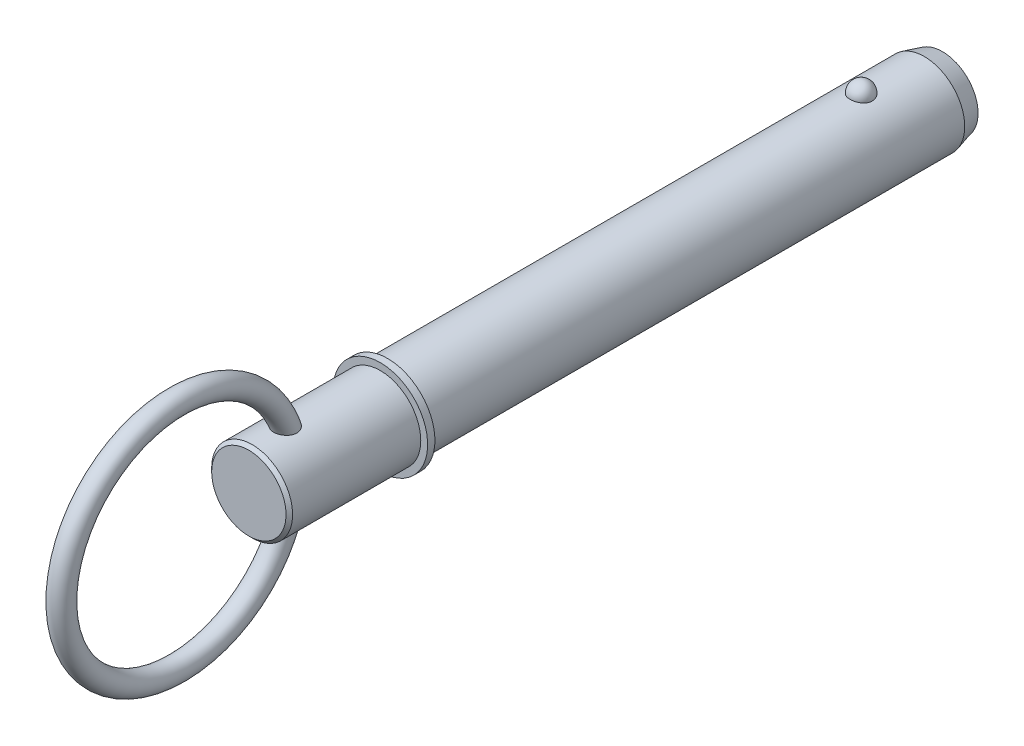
ISO-10303-21;
HEADER;
FILE_DESCRIPTION(('STEP AP214'),'2;1');
FILE_NAME('part.step','',(''),(''),'','','');
FILE_SCHEMA(('AUTOMOTIVE_DESIGN { 1 0 10303 214 1 1 1 1 }'));
ENDSEC;
DATA;
#1=APPLICATION_CONTEXT('core data for automotive mechanical design processes');
#2=APPLICATION_PROTOCOL_DEFINITION('international standard','automotive_design',2000,#1);
#3=PRODUCT_CONTEXT('',#1,'mechanical');
#4=PRODUCT('Part','Part','',(#3));
#5=PRODUCT_RELATED_PRODUCT_CATEGORY('part','',(#4));
#6=PRODUCT_DEFINITION_FORMATION('','',#4);
#7=PRODUCT_DEFINITION_CONTEXT('part definition',#1,'design');
#8=PRODUCT_DEFINITION('design','',#6,#7);
#9=PRODUCT_DEFINITION_SHAPE('','',#8);
#10=(LENGTH_UNIT() NAMED_UNIT(*) SI_UNIT(.MILLI.,.METRE.));
#11=(NAMED_UNIT(*) PLANE_ANGLE_UNIT() SI_UNIT($,.RADIAN.));
#12=(NAMED_UNIT(*) SI_UNIT($,.STERADIAN.) SOLID_ANGLE_UNIT());
#13=UNCERTAINTY_MEASURE_WITH_UNIT(LENGTH_MEASURE(1.E-05),#10,'distance_accuracy_value','');
#14=(GEOMETRIC_REPRESENTATION_CONTEXT(3) GLOBAL_UNCERTAINTY_ASSIGNED_CONTEXT((#13)) GLOBAL_UNIT_ASSIGNED_CONTEXT((#10,
#11,#12)) REPRESENTATION_CONTEXT('',''));
#15=CARTESIAN_POINT('',(0.,0.,0.));
#16=DIRECTION('',(0.,0.,1.));
#17=DIRECTION('',(1.,0.,0.));
#18=AXIS2_PLACEMENT_3D('',#15,#16,#17);
#19=CARTESIAN_POINT('',(0.,0.,127.));
#20=DIRECTION('',(0.,0.,-1.));
#21=DIRECTION('',(-1.,0.,0.));
#22=AXIS2_PLACEMENT_3D('',#19,#20,#21);
#23=CYLINDRICAL_SURFACE('',#22,11.115);
#24=CARTESIAN_POINT('',(3.04058343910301,10.6910278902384,-3.07));
#25=CARTESIAN_POINT('',(3.04058039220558,10.6910304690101,-2.89837124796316));
#26=CARTESIAN_POINT('',(3.02657193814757,10.6950430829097,-2.72670368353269));
#27=CARTESIAN_POINT('',(2.97087341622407,10.7106465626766,-2.38822964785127));
#28=CARTESIAN_POINT('',(2.92917240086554,10.7222404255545,-2.22142512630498));
#29=CARTESIAN_POINT('',(2.81915317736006,10.751689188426,-1.89750816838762));
#30=CARTESIAN_POINT('',(2.75084669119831,10.7695413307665,-1.7403914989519));
#31=CARTESIAN_POINT('',(2.58932284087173,10.809510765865,-1.44013959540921));
#32=CARTESIAN_POINT('',(2.49610617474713,10.8316279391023,-1.29700396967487));
#33=CARTESIAN_POINT('',(2.28659317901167,10.877786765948,-1.02797591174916));
#34=CARTESIAN_POINT('',(2.17018825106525,10.9018371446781,-0.902169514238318));
#35=CARTESIAN_POINT('',(1.91759004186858,10.9490888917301,-0.672091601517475));
#36=CARTESIAN_POINT('',(1.78139672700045,10.9722902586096,-0.567820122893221));
#37=CARTESIAN_POINT('',(1.49327884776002,11.0151925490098,-0.383992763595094));
#38=CARTESIAN_POINT('',(1.34139928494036,11.034903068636,-0.30436866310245));
#39=CARTESIAN_POINT('',(1.02584823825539,11.0686948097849,-0.171731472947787));
#40=CARTESIAN_POINT('',(0.86217801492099,11.0827766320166,-0.118715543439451));
#41=CARTESIAN_POINT('',(0.530748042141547,11.1035404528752,-0.0415304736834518));
#42=CARTESIAN_POINT('',(0.363109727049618,11.1103474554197,-0.0168734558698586));
#43=CARTESIAN_POINT('',(0.0259327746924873,11.1162480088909,0.00453486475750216));
#44=CARTESIAN_POINT('',(-0.143605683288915,11.1153422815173,0.00128877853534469));
#45=CARTESIAN_POINT('',(-0.477280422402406,11.1059854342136,-0.0327676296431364));
#46=CARTESIAN_POINT('',(-0.641459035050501,11.0976393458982,-0.0631942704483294));
#47=CARTESIAN_POINT('',(-0.962236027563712,11.0744390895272,-0.150220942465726));
#48=CARTESIAN_POINT('',(-1.11883427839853,11.0595848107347,-0.20682141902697));
#49=CARTESIAN_POINT('',(-1.4210461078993,11.0248420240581,-0.345028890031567));
#50=CARTESIAN_POINT('',(-1.56659244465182,11.0049254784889,-0.426775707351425));
#51=CARTESIAN_POINT('',(-1.84189316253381,10.9622119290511,-0.612956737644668));
#52=CARTESIAN_POINT('',(-1.97164597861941,10.9394146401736,-0.71739319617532));
#53=CARTESIAN_POINT('',(-2.21432263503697,10.8929139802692,-0.948332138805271));
#54=CARTESIAN_POINT('',(-2.3268890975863,10.8692016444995,-1.07520847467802));
#55=CARTESIAN_POINT('',(-2.52940007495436,10.8238699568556,-1.34622145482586));
#56=CARTESIAN_POINT('',(-2.6193430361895,10.8022507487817,-1.49035928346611));
#57=CARTESIAN_POINT('',(-2.77523958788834,10.7632629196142,-1.79367507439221));
#58=CARTESIAN_POINT('',(-2.8409151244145,10.7459442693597,-1.95300253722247));
#59=CARTESIAN_POINT('',(-2.94519180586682,10.7178360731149,-2.28083009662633));
#60=CARTESIAN_POINT('',(-2.98379371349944,10.707046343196,-2.44932993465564));
#61=CARTESIAN_POINT('',(-3.03284665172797,10.6932559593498,-2.78998091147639));
#62=CARTESIAN_POINT('',(-3.04341313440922,10.6902233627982,-2.96211412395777));
#63=CARTESIAN_POINT('',(-3.03646037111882,10.6922002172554,-3.305762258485));
#64=CARTESIAN_POINT('',(-3.0189418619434,10.6972094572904,-3.47727719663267));
#65=CARTESIAN_POINT('',(-2.95641582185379,10.7146564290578,-3.81396465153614));
#66=CARTESIAN_POINT('',(-2.91154117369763,10.7270582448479,-3.97916375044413));
#67=CARTESIAN_POINT('',(-2.79553341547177,10.7578713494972,-4.29947360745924));
#68=CARTESIAN_POINT('',(-2.72439927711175,10.7762828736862,-4.45458397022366));
#69=CARTESIAN_POINT('',(-2.55718900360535,10.8171819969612,-4.75123550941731));
#70=CARTESIAN_POINT('',(-2.46098224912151,10.8396907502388,-4.89270014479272));
#71=CARTESIAN_POINT('',(-2.24623042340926,10.8862165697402,-5.15724095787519));
#72=CARTESIAN_POINT('',(-2.12768452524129,10.9102336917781,-5.28031645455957));
#73=CARTESIAN_POINT('',(-1.87085107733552,10.9571990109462,-5.5050961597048));
#74=CARTESIAN_POINT('',(-1.73249451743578,10.9801430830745,-5.60672245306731));
#75=CARTESIAN_POINT('',(-1.44010079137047,11.0223008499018,-5.78517789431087));
#76=CARTESIAN_POINT('',(-1.28606470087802,11.0415148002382,-5.86200874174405));
#77=CARTESIAN_POINT('',(-0.968615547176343,11.0738491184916,-5.98788441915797));
#78=CARTESIAN_POINT('',(-0.805339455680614,11.0870408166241,-6.03725610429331));
#79=CARTESIAN_POINT('',(-0.47244987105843,11.1062048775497,-6.10820004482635));
#80=CARTESIAN_POINT('',(-0.302837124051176,11.11217808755,-6.1297755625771));
#81=CARTESIAN_POINT('',(0.0345765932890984,11.1162034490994,-6.14436196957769));
#82=CARTESIAN_POINT('',(0.20235372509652,11.1143988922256,-6.13788957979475));
#83=CARTESIAN_POINT('',(0.534364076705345,11.103390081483,-6.09773981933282));
#84=CARTESIAN_POINT('',(0.698597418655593,11.094186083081,-6.06406338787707));
#85=CARTESIAN_POINT('',(1.01830314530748,11.0694136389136,-5.97063285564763));
#86=CARTESIAN_POINT('',(1.17380497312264,11.0538682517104,-5.91097318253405));
#87=CARTESIAN_POINT('',(1.472484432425,11.0180608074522,-5.76723645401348));
#88=CARTESIAN_POINT('',(1.6156613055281,10.9977984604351,-5.68315789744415));
#89=CARTESIAN_POINT('',(1.88801614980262,10.9543574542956,-5.49138807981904));
#90=CARTESIAN_POINT('',(2.01695079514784,10.9311394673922,-5.38336024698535));
#91=CARTESIAN_POINT('',(2.25501495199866,10.8845248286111,-5.14733839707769));
#92=CARTESIAN_POINT('',(2.36414099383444,10.8611281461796,-5.01934088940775));
#93=CARTESIAN_POINT('',(2.56152595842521,10.8162958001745,-4.74447932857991));
#94=CARTESIAN_POINT('',(2.64940088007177,10.7948999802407,-4.59733288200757));
#95=CARTESIAN_POINT('',(2.79961494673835,10.7569242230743,-4.29001203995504));
#96=CARTESIAN_POINT('',(2.86196390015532,10.7403424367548,-4.12984267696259));
#97=CARTESIAN_POINT('',(2.95377333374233,10.715429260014,-3.820623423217));
#98=CARTESIAN_POINT('',(2.98627018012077,10.7063495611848,-3.6725268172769));
#99=CARTESIAN_POINT('',(3.02967634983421,10.6941478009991,-3.37296350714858));
#100=CARTESIAN_POINT('',(3.04058612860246,10.6910256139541,-3.22149687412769));
#101=CARTESIAN_POINT('',(3.04058343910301,10.6910278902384,-3.07));
#102=B_SPLINE_CURVE_WITH_KNOTS('',3,(#24,#25,#26,#27,#28,#29,#30,#31,#32,#33,#34,#35,#36,#37,
#38,#39,#40,#41,#42,#43,#44,#45,#46,#47,#48,#49,#50,#51,#52,#53,#54,#55,#56,#57,#58,#59,#60,#61,
#62,#63,#64,#65,#66,#67,#68,#69,#70,#71,#72,#73,#74,#75,#76,#77,#78,#79,#80,#81,#82,#83,#84,#85,
#86,#87,#88,#89,#90,#91,#92,#93,#94,#95,#96,#97,#98,#99,#100,#101),.UNSPECIFIED.,.T.,.F.,(4,2,2,
2,2,2,2,2,2,2,2,2,2,2,2,2,2,2,2,2,2,2,2,2,2,2,2,2,2,2,2,2,2,2,2,2,2,2,4),(0.,0.514341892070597,
1.02888723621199,1.54320613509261,2.0575106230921,2.57428293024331,3.09105611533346,
3.60638589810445,4.1216606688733,4.62793159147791,5.1341551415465,5.63334381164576,
6.13254097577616,6.63456562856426,7.13663998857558,7.64804063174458,8.15947638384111,
8.6766026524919,9.19371435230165,9.70869321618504,10.223658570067,10.7361421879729,
11.2486458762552,11.7638748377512,12.2791228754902,12.7962115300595,13.3132647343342,
13.8240238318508,14.3347229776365,14.8360540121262,15.3373677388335,15.8368746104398,
16.3364121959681,16.8434736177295,17.3506237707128,17.8663484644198,18.3818748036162,
18.8358944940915,19.2899046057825),.UNSPECIFIED.);
#103=CARTESIAN_POINT('',(3.04058343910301,10.6910278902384,-3.07));
#104=VERTEX_POINT('',#103);
#105=EDGE_CURVE('E103',#104,#104,#102,.T.);
#106=ORIENTED_EDGE('',*,*,#105,.T.);
#107=EDGE_LOOP('',(#106));
#108=FACE_BOUND('',#107,.T.);
#109=CARTESIAN_POINT('',(0.,0.,-20.4));
#110=DIRECTION('',(0.,0.,-1.));
#111=DIRECTION('',(-1.,0.,0.));
#112=AXIS2_PLACEMENT_3D('',#109,#110,#111);
#113=CIRCLE('',#112,11.115);
#114=CARTESIAN_POINT('',(-11.115,0.,-20.4));
#115=VERTEX_POINT('',#114);
#116=EDGE_CURVE('E110',#115,#115,#113,.F.);
#117=ORIENTED_EDGE('',*,*,#116,.T.);
#118=EDGE_LOOP('',(#117));
#119=FACE_BOUND('',#118,.T.);
#120=CARTESIAN_POINT('',(0.,0.,127.));
#121=DIRECTION('',(0.,0.,1.));
#122=DIRECTION('',(1.,0.,0.));
#123=AXIS2_PLACEMENT_3D('',#120,#121,#122);
#124=CIRCLE('',#123,11.115);
#125=CARTESIAN_POINT('',(11.115,0.,127.));
#126=VERTEX_POINT('',#125);
#127=EDGE_CURVE('E108',#126,#126,#124,.T.);
#128=ORIENTED_EDGE('',*,*,#127,.F.);
#129=EDGE_LOOP('',(#128));
#130=FACE_BOUND('',#129,.T.);
#131=ADVANCED_FACE('F39',(#108,#119,#130),#23,.T.);
#132=CARTESIAN_POINT('',(0.,0.,-25.4));
#133=DIRECTION('',(0.,0.,-1.));
#134=DIRECTION('',(-1.,0.,0.));
#135=AXIS2_PLACEMENT_3D('',#132,#133,#134);
#136=PLANE('',#135);
#137=CARTESIAN_POINT('',(0.,0.,-25.4));
#138=DIRECTION('',(0.,0.,-1.));
#139=DIRECTION('',(-1.,0.,0.));
#140=AXIS2_PLACEMENT_3D('',#137,#138,#139);
#141=CIRCLE('',#140,9.77525403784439);
#142=CARTESIAN_POINT('',(-9.77525403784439,0.,-25.4));
#143=VERTEX_POINT('',#142);
#144=EDGE_CURVE('E140',#143,#143,#141,.T.);
#145=ORIENTED_EDGE('',*,*,#144,.T.);
#146=EDGE_LOOP('',(#145));
#147=FACE_BOUND('',#146,.T.);
#148=ADVANCED_FACE('F89',(#147),#136,.T.);
#149=CARTESIAN_POINT('',(0.,0.,-25.4));
#150=DIRECTION('',(0.,0.,1.));
#151=DIRECTION('',(1.,0.,0.));
#152=AXIS2_PLACEMENT_3D('',#149,#150,#151);
#153=CONICAL_SURFACE('',#152,9.77525403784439,0.261799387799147);
#154=ORIENTED_EDGE('',*,*,#116,.F.);
#155=EDGE_LOOP('',(#154));
#156=FACE_BOUND('',#155,.T.);
#157=ORIENTED_EDGE('',*,*,#144,.F.);
#158=EDGE_LOOP('',(#157));
#159=FACE_BOUND('',#158,.T.);
#160=ADVANCED_FACE('F95',(#156,#159),#153,.T.);
#161=CARTESIAN_POINT('',(0.,11.115,-3.07));
#162=DIRECTION('',(0.,1.,0.));
#163=DIRECTION('',(0.,0.,-1.));
#164=AXIS2_PLACEMENT_3D('',#161,#162,#163);
#165=SPHERICAL_SURFACE('',#164,3.07);
#166=ORIENTED_EDGE('',*,*,#105,.F.);
#167=EDGE_LOOP('',(#166));
#168=FACE_BOUND('',#167,.T.);
#169=ADVANCED_FACE('F113',(#168),#165,.T.);
#170=CARTESIAN_POINT('',(0.,0.,127.));
#171=DIRECTION('',(0.,0.,-1.));
#172=DIRECTION('',(-1.,0.,0.));
#173=AXIS2_PLACEMENT_3D('',#170,#171,#172);
#174=PLANE('',#173);
#175=ORIENTED_EDGE('',*,*,#127,.T.);
#176=EDGE_LOOP('',(#175));
#177=FACE_BOUND('',#176,.T.);
#178=CARTESIAN_POINT('',(0.,0.,127.));
#179=DIRECTION('',(0.,0.,-1.));
#180=DIRECTION('',(-1.,0.,0.));
#181=AXIS2_PLACEMENT_3D('',#178,#179,#180);
#182=CIRCLE('',#181,13.);
#183=CARTESIAN_POINT('',(-13.,0.,127.));
#184=VERTEX_POINT('',#183);
#185=EDGE_CURVE('E109',#184,#184,#182,.T.);
#186=ORIENTED_EDGE('',*,*,#185,.T.);
#187=EDGE_LOOP('',(#186));
#188=FACE_BOUND('',#187,.T.);
#189=ADVANCED_FACE('F117',(#177,#188),#174,.T.);
#190=CARTESIAN_POINT('',(0.,0.,33.7287874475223));
#191=DIRECTION('',(0.,0.,-1.));
#192=DIRECTION('',(-1.,0.,0.));
#193=AXIS2_PLACEMENT_3D('',#190,#191,#192);
#194=CYLINDRICAL_SURFACE('',#193,13.);
#195=CARTESIAN_POINT('',(0.,0.,129.));
#196=DIRECTION('',(0.,0.,-1.));
#197=DIRECTION('',(-1.,0.,0.));
#198=AXIS2_PLACEMENT_3D('',#195,#196,#197);
#199=CIRCLE('',#198,13.);
#200=CARTESIAN_POINT('',(-13.,0.,129.));
#201=VERTEX_POINT('',#200);
#202=EDGE_CURVE('E134',#201,#201,#199,.T.);
#203=ORIENTED_EDGE('',*,*,#202,.T.);
#204=EDGE_LOOP('',(#203));
#205=FACE_BOUND('',#204,.T.);
#206=ORIENTED_EDGE('',*,*,#185,.F.);
#207=EDGE_LOOP('',(#206));
#208=FACE_BOUND('',#207,.T.);
#209=ADVANCED_FACE('F121',(#205,#208),#194,.T.);
#210=CARTESIAN_POINT('',(0.,13.,129.));
#211=DIRECTION('',(0.,0.,1.));
#212=DIRECTION('',(1.,0.,0.));
#213=AXIS2_PLACEMENT_3D('',#210,#211,#212);
#214=PLANE('',#213);
#215=CARTESIAN_POINT('',(0.,0.,129.));
#216=DIRECTION('',(0.,0.,1.));
#217=DIRECTION('',(1.,0.,0.));
#218=AXIS2_PLACEMENT_3D('',#215,#216,#217);
#219=CIRCLE('',#218,11.115);
#220=CARTESIAN_POINT('',(11.115,0.,129.));
#221=VERTEX_POINT('',#220);
#222=EDGE_CURVE('E112',#221,#221,#219,.T.);
#223=ORIENTED_EDGE('',*,*,#222,.F.);
#224=EDGE_LOOP('',(#223));
#225=FACE_BOUND('',#224,.T.);
#226=ORIENTED_EDGE('',*,*,#202,.F.);
#227=EDGE_LOOP('',(#226));
#228=FACE_BOUND('',#227,.T.);
#229=ADVANCED_FACE('F86',(#225,#228),#214,.T.);
#230=CARTESIAN_POINT('',(0.,0.,165.1));
#231=DIRECTION('',(0.,0.,-1.));
#232=DIRECTION('',(-1.,0.,0.));
#233=AXIS2_PLACEMENT_3D('',#230,#231,#232);
#234=CYLINDRICAL_SURFACE('',#233,11.115);
#235=CARTESIAN_POINT('',(-1.22435852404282,-11.0473603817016,152.178419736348));
#236=CARTESIAN_POINT('',(-1.0707801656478,-11.0643805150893,152.111699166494));
#237=CARTESIAN_POINT('',(-0.911372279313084,-11.0787777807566,152.057745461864));
#238=CARTESIAN_POINT('',(-0.585451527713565,-11.1007717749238,151.976552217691));
#239=CARTESIAN_POINT('',(-0.418938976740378,-11.1083688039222,151.949311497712));
#240=CARTESIAN_POINT('',(-0.0835394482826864,-11.1159515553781,151.922121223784));
#241=CARTESIAN_POINT('',(0.0853474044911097,-11.1159376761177,151.922170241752));
#242=CARTESIAN_POINT('',(0.420723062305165,-11.1083011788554,151.949554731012));
#243=CARTESIAN_POINT('',(0.58721183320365,-11.1006784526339,151.976890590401));
#244=CARTESIAN_POINT('',(0.913189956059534,-11.0786293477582,152.05829957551));
#245=CARTESIAN_POINT('',(1.07267378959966,-11.0641977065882,152.112393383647));
#246=CARTESIAN_POINT('',(1.3799404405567,-11.0300907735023,152.246140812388));
#247=CARTESIAN_POINT('',(1.52772335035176,-11.0104155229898,152.325794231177));
#248=CARTESIAN_POINT('',(1.80679367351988,-10.9680716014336,152.508467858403));
#249=CARTESIAN_POINT('',(1.93814041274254,-10.945414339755,152.611400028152));
#250=CARTESIAN_POINT('',(2.18117403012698,-10.8995884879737,152.838212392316));
#251=CARTESIAN_POINT('',(2.29286356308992,-10.8764199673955,152.962089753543));
#252=CARTESIAN_POINT('',(2.49238969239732,-10.8324319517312,153.225992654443));
#253=CARTESIAN_POINT('',(2.58046870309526,-10.8115899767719,153.365831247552));
#254=CARTESIAN_POINT('',(2.73218762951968,-10.7742522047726,153.658691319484));
#255=CARTESIAN_POINT('',(2.7958294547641,-10.757756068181,153.811711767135));
#256=CARTESIAN_POINT('',(2.89767977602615,-10.7307723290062,154.1266092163));
#257=CARTESIAN_POINT('',(2.93586554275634,-10.7202900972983,154.288493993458));
#258=CARTESIAN_POINT('',(2.98678800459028,-10.7062139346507,154.616480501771));
#259=CARTESIAN_POINT('',(2.99951894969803,-10.7026215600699,154.782583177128));
#260=CARTESIAN_POINT('',(3.0004780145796,-10.7023530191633,155.123227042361));
#261=CARTESIAN_POINT('',(2.98743421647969,-10.7060358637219,155.297770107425));
#262=CARTESIAN_POINT('',(2.93592917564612,-10.7202719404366,155.642750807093));
#263=CARTESIAN_POINT('',(2.8974582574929,-10.7308277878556,155.813186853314));
#264=CARTESIAN_POINT('',(2.79180512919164,-10.7588257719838,156.163114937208));
#265=CARTESIAN_POINT('',(2.72213928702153,-10.776850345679,156.341811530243));
#266=CARTESIAN_POINT('',(2.55612841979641,-10.8174264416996,156.685974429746));
#267=CARTESIAN_POINT('',(2.4597569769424,-10.8399824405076,156.851427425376));
#268=CARTESIAN_POINT('',(2.23434632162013,-10.8887625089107,157.175672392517));
#269=CARTESIAN_POINT('',(2.10349593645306,-10.9151327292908,157.333192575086));
#270=CARTESIAN_POINT('',(1.81505097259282,-10.96677510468,157.621668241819));
#271=CARTESIAN_POINT('',(1.65749731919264,-10.9920488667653,157.75266371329));
#272=CARTESIAN_POINT('',(1.36197799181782,-11.0319737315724,157.951313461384));
#273=CARTESIAN_POINT('',(1.22927684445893,-11.0476896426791,158.02660092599));
#274=CARTESIAN_POINT('',(0.952979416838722,-11.0749380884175,158.154574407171));
#275=CARTESIAN_POINT('',(0.809393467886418,-11.0864745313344,158.207281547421));
#276=CARTESIAN_POINT('',(0.513954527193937,-11.1041011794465,158.287058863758));
#277=CARTESIAN_POINT('',(0.362058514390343,-11.1101594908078,158.313978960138));
#278=CARTESIAN_POINT('',(0.0557792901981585,-11.1159132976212,158.339559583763));
#279=CARTESIAN_POINT('',(-0.0986030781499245,-11.1156109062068,158.338229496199));
#280=CARTESIAN_POINT('',(-0.389768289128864,-11.1090283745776,158.308935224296));
#281=CARTESIAN_POINT('',(-0.526830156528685,-11.1033186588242,158.283512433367));
#282=CARTESIAN_POINT('',(-0.794878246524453,-11.0873547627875,158.211270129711));
#283=CARTESIAN_POINT('',(-0.925863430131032,-11.0770998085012,158.164446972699));
#284=CARTESIAN_POINT('',(-1.18354406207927,-11.0525934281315,158.049843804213));
#285=CARTESIAN_POINT('',(-1.30991621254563,-11.0382116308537,157.981371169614));
#286=CARTESIAN_POINT('',(-1.55122352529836,-11.0068962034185,157.827131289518));
#287=CARTESIAN_POINT('',(-1.66615377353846,-10.9899614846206,157.741356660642));
#288=CARTESIAN_POINT('',(-1.90024050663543,-10.9520991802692,157.54087205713));
#289=CARTESIAN_POINT('',(-2.01728342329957,-10.9309598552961,157.423737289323));
#290=CARTESIAN_POINT('',(-2.23333659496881,-10.8888735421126,157.173839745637));
#291=CARTESIAN_POINT('',(-2.33233396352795,-10.8679267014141,157.041065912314));
#292=CARTESIAN_POINT('',(-2.52607041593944,-10.8246766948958,156.740000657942));
#293=CARTESIAN_POINT('',(-2.61741570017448,-10.8027194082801,156.569462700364));
#294=CARTESIAN_POINT('',(-2.77251687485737,-10.7639568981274,156.215671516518));
#295=CARTESIAN_POINT('',(-2.83625783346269,-10.7471544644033,156.032411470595));
#296=CARTESIAN_POINT('',(-2.93668505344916,-10.7201706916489,155.646624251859));
#297=CARTESIAN_POINT('',(-2.97161961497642,-10.7104219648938,155.443594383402));
#298=CARTESIAN_POINT('',(-2.99683495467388,-10.7033740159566,155.136874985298));
#299=CARTESIAN_POINT('',(-3.00070536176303,-10.7022882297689,155.034234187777));
#300=CARTESIAN_POINT('',(-2.99908594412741,-10.7027439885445,154.829049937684));
#301=CARTESIAN_POINT('',(-2.99360154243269,-10.7042840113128,154.726506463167));
#302=CARTESIAN_POINT('',(-2.97382504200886,-10.7097936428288,154.530330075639));
#303=CARTESIAN_POINT('',(-2.9602439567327,-10.7135669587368,154.436619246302));
#304=CARTESIAN_POINT('',(-2.92480741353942,-10.723295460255,154.250932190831));
#305=CARTESIAN_POINT('',(-2.90295619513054,-10.7292495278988,154.15895510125));
#306=CARTESIAN_POINT('',(-2.85097003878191,-10.7431800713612,153.977547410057));
#307=CARTESIAN_POINT('',(-2.82083748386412,-10.7511559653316,153.888116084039));
#308=CARTESIAN_POINT('',(-2.75241691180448,-10.7688750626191,153.71264532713));
#309=CARTESIAN_POINT('',(-2.71412954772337,-10.7786181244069,153.62660562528));
#310=CARTESIAN_POINT('',(-2.59550576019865,-10.807996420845,153.391055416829));
#311=CARTESIAN_POINT('',(-2.50612224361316,-10.8292837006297,153.246173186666));
#312=CARTESIAN_POINT('',(-2.30366035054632,-10.8741467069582,152.974571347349));
#313=CARTESIAN_POINT('',(-2.19058370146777,-10.8977222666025,152.847850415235));
#314=CARTESIAN_POINT('',(-1.94442412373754,-10.9443154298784,152.616462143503));
#315=CARTESIAN_POINT('',(-1.81141354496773,-10.967334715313,152.51171820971));
#316=CARTESIAN_POINT('',(-1.52904284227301,-11.0102504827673,152.326435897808));
#317=CARTESIAN_POINT('',(-1.37968206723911,-11.0301468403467,152.245898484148));
#318=CARTESIAN_POINT('',(-1.22435852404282,-11.0473603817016,152.178419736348));
#319=B_SPLINE_CURVE_WITH_KNOTS('',3,(#235,#236,#237,#238,#239,#240,#241,#242,#243,#244,#245,
#246,#247,#248,#249,#250,#251,#252,#253,#254,#255,#256,#257,#258,#259,#260,#261,#262,#263,#264,
#265,#266,#267,#268,#269,#270,#271,#272,#273,#274,#275,#276,#277,#278,#279,#280,#281,#282,#283,
#284,#285,#286,#287,#288,#289,#290,#291,#292,#293,#294,#295,#296,#297,#298,#299,#300,#301,#302,
#303,#304,#305,#306,#307,#308,#309,#310,#311,#312,#313,#314,#315,#316,#317,#318),.UNSPECIFIED.,
.T.,.F.,(4,2,2,2,2,2,2,2,2,2,2,2,2,2,2,2,2,2,2,2,2,2,2,2,2,2,2,2,2,2,2,2,2,2,2,2,2,2,2,2,2,4),
(0.,0.504317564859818,1.00861284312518,1.51288173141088,2.01715779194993,2.52182424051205,
3.02648670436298,3.52927157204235,4.03198848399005,4.52932690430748,5.02662645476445,
5.5243694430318,6.02222485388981,6.545261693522,7.06849767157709,7.64398785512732,
8.22004937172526,8.83633461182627,9.45168373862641,9.90997173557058,10.3678300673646,
10.8283372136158,11.2886913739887,11.7053264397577,12.1220324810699,12.5537129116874,
12.9855779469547,13.4844842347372,13.9837454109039,14.5653303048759,15.1472294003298,
15.762338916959,16.0701226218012,16.3777279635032,16.6616380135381,16.9454027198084,
17.229085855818,17.5127462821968,18.0246262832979,18.5364689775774,19.0464970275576,
19.5565453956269),.UNSPECIFIED.);
#320=CARTESIAN_POINT('',(-1.22435852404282,-11.0473603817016,152.178419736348));
#321=VERTEX_POINT('',#320);
#322=EDGE_CURVE('E10',#321,#321,#319,.T.);
#323=ORIENTED_EDGE('',*,*,#322,.F.);
#324=EDGE_LOOP('',(#323));
#325=FACE_BOUND('',#324,.T.);
#326=CARTESIAN_POINT('',(-1.22435852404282,11.0473603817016,152.178419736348));
#327=CARTESIAN_POINT('',(-1.3763077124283,11.0305212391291,152.244431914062));
#328=CARTESIAN_POINT('',(-1.5225432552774,11.0111158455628,152.322938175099));
#329=CARTESIAN_POINT('',(-1.79945383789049,10.9692671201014,152.50315338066));
#330=CARTESIAN_POINT('',(-1.9301301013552,10.9468240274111,152.604860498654));
#331=CARTESIAN_POINT('',(-2.17227655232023,10.9013603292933,152.829035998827));
#332=CARTESIAN_POINT('',(-2.28373752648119,10.8783394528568,152.951514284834));
#333=CARTESIAN_POINT('',(-2.4842745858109,10.8343057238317,153.213895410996));
#334=CARTESIAN_POINT('',(-2.57335330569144,10.8132926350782,153.353796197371));
#335=CARTESIAN_POINT('',(-2.72640074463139,10.7757209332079,153.645964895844));
#336=CARTESIAN_POINT('',(-2.79054231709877,10.7591319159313,153.79813851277));
#337=CARTESIAN_POINT('',(-2.89354234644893,10.7318913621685,154.111286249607));
#338=CARTESIAN_POINT('',(-2.932399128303,10.7212402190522,154.272260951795));
#339=CARTESIAN_POINT('',(-2.98540436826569,10.7066038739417,154.601955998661));
#340=CARTESIAN_POINT('',(-2.9990165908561,10.7027634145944,154.770768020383));
#341=CARTESIAN_POINT('',(-3.0008814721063,10.7022388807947,155.108508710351));
#342=CARTESIAN_POINT('',(-2.98912652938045,10.7055569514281,155.277437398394));
#343=CARTESIAN_POINT('',(-2.93985175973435,10.7191979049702,155.624856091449));
#344=CARTESIAN_POINT('',(-2.90036626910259,10.7300544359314,155.803044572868));
#345=CARTESIAN_POINT('',(-2.7955500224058,10.7578360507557,156.151215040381));
#346=CARTESIAN_POINT('',(-2.73019988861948,10.774765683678,156.321190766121));
#347=CARTESIAN_POINT('',(-2.56762574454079,10.8147227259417,156.665784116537));
#348=CARTESIAN_POINT('',(-2.46786230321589,10.838191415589,156.839157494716));
#349=CARTESIAN_POINT('',(-2.24100420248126,10.8873575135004,157.166686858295));
#350=CARTESIAN_POINT('',(-2.11391925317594,10.9130541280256,157.320849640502));
#351=CARTESIAN_POINT('',(-1.85542700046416,10.9597063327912,157.582735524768));
#352=CARTESIAN_POINT('',(-1.72758345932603,10.9807909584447,157.693955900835));
#353=CARTESIAN_POINT('',(-1.45489931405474,11.0202250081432,157.89412236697));
#354=CARTESIAN_POINT('',(-1.31006770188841,11.0385758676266,157.983080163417));
#355=CARTESIAN_POINT('',(-1.08171164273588,11.0625084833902,158.0963702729));
#356=CARTESIAN_POINT('',(-1.00332234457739,11.069914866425,158.130896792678));
#357=CARTESIAN_POINT('',(-0.843525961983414,11.0832350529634,158.192391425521));
#358=CARTESIAN_POINT('',(-0.76212057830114,11.0891496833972,158.219363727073));
#359=CARTESIAN_POINT('',(-0.597014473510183,11.0992628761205,158.26518193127));
#360=CARTESIAN_POINT('',(-0.51331556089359,11.1034627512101,158.284034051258));
#361=CARTESIAN_POINT('',(-0.344374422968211,11.1099851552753,158.313209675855));
#362=CARTESIAN_POINT('',(-0.259132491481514,11.1123080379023,158.323534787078));
#363=CARTESIAN_POINT('',(-0.100838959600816,11.114780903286,158.334519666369));
#364=CARTESIAN_POINT('',(-0.0278735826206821,11.1152042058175,158.336395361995));
#365=CARTESIAN_POINT('',(0.117962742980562,11.1146132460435,158.333773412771));
#366=CARTESIAN_POINT('',(0.190833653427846,11.1135985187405,158.329273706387));
#367=CARTESIAN_POINT('',(0.33584265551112,11.110161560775,158.313978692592));
#368=CARTESIAN_POINT('',(0.407981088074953,11.1077400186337,158.303186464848));
#369=CARTESIAN_POINT('',(0.551029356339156,11.1015643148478,158.275503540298));
#370=CARTESIAN_POINT('',(0.621938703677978,11.0978096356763,158.258610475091));
#371=CARTESIAN_POINT('',(0.82538178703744,11.0851145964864,158.201054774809));
#372=CARTESIAN_POINT('',(0.955713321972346,11.0745538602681,158.152705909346));
#373=CARTESIAN_POINT('',(1.20733127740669,11.0499605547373,158.037325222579));
#374=CARTESIAN_POINT('',(1.32861527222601,11.0359270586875,157.970288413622));
#375=CARTESIAN_POINT('',(1.57344360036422,11.0038352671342,157.811843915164));
#376=CARTESIAN_POINT('',(1.69572941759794,10.9855025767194,157.718551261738));
#377=CARTESIAN_POINT('',(1.92565215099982,10.9475431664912,157.515650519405));
#378=CARTESIAN_POINT('',(2.0332801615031,10.9279156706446,157.406032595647));
#379=CARTESIAN_POINT('',(2.25048911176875,10.8854412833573,157.15299112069));
#380=CARTESIAN_POINT('',(2.35710396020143,10.8626332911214,157.007010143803));
#381=CARTESIAN_POINT('',(2.5475731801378,10.8195493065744,156.700478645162));
#382=CARTESIAN_POINT('',(2.63141052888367,10.799275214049,156.539917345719));
#383=CARTESIAN_POINT('',(2.78342312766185,10.7611645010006,156.187827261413));
#384=CARTESIAN_POINT('',(2.84851472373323,10.7439117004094,155.994893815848));
#385=CARTESIAN_POINT('',(2.9456265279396,10.7177011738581,155.600130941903));
#386=CARTESIAN_POINT('',(2.97764942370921,10.7087427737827,155.39830223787));
#387=CARTESIAN_POINT('',(2.99864828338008,10.7028651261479,155.095989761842));
#388=CARTESIAN_POINT('',(3.00125529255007,10.7021342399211,154.996378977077));
#389=CARTESIAN_POINT('',(2.9976304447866,10.7031517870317,154.797345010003));
#390=CARTESIAN_POINT('',(2.99140295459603,10.704898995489,154.697921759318));
#391=CARTESIAN_POINT('',(2.96990080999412,10.710883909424,154.500179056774));
#392=CARTESIAN_POINT('',(2.95463019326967,10.7151205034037,154.401859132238));
#393=CARTESIAN_POINT('',(2.91493260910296,10.7259879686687,154.207219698));
#394=CARTESIAN_POINT('',(2.89050674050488,10.7326185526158,154.110899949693));
#395=CARTESIAN_POINT('',(2.83556656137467,10.7472556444,153.931222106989));
#396=CARTESIAN_POINT('',(2.80596337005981,10.7550439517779,153.847566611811));
#397=CARTESIAN_POINT('',(2.7395310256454,10.7721572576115,153.683300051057));
#398=CARTESIAN_POINT('',(2.70269935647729,10.7814827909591,153.602690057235));
#399=CARTESIAN_POINT('',(2.6220344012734,10.801383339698,153.445273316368));
#400=CARTESIAN_POINT('',(2.57820565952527,10.8119575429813,153.368464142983));
#401=CARTESIAN_POINT('',(2.48382482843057,10.8340293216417,153.219223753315));
#402=CARTESIAN_POINT('',(2.4332703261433,10.8455272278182,153.146794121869));
#403=CARTESIAN_POINT('',(2.27895739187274,10.879345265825,152.945992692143));
#404=CARTESIAN_POINT('',(2.16717186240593,10.9023791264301,152.823764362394));
#405=CARTESIAN_POINT('',(1.92442677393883,10.9478318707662,152.600151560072));
#406=CARTESIAN_POINT('',(1.79346836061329,10.9702507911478,152.498765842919));
#407=CARTESIAN_POINT('',(1.51657151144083,11.0119360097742,152.319564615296));
#408=CARTESIAN_POINT('',(1.37069187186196,11.0312139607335,152.241661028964));
#409=CARTESIAN_POINT('',(1.0676440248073,11.0646548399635,152.110680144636));
#410=CARTESIAN_POINT('',(0.910475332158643,11.0788175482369,152.057603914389));
#411=CARTESIAN_POINT('',(0.587492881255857,11.1006548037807,151.97697871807));
#412=CARTESIAN_POINT('',(0.421604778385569,11.1082585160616,151.949708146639));
#413=CARTESIAN_POINT('',(0.0874262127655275,11.1159127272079,151.922259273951));
#414=CARTESIAN_POINT('',(-0.0808643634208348,11.1159628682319,151.92208225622));
#415=CARTESIAN_POINT('',(-0.416252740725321,11.1084780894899,151.948918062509));
#416=CARTESIAN_POINT('',(-0.583334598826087,11.1008914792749,151.976116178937));
#417=CARTESIAN_POINT('',(-0.910355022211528,11.0788693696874,152.057401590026));
#418=CARTESIAN_POINT('',(-1.07029370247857,11.064433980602,152.111488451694));
#419=CARTESIAN_POINT('',(-1.22435852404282,11.0473603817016,152.178419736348));
#420=B_SPLINE_CURVE_WITH_KNOTS('',3,(#326,#327,#328,#329,#330,#331,#332,#333,#334,#335,#336,
#337,#338,#339,#340,#341,#342,#343,#344,#345,#346,#347,#348,#349,#350,#351,#352,#353,#354,#355,
#356,#357,#358,#359,#360,#361,#362,#363,#364,#365,#366,#367,#368,#369,#370,#371,#372,#373,#374,
#375,#376,#377,#378,#379,#380,#381,#382,#383,#384,#385,#386,#387,#388,#389,#390,#391,#392,#393,
#394,#395,#396,#397,#398,#399,#400,#401,#402,#403,#404,#405,#406,#407,#408,#409,#410,#411,#412,
#413,#414,#415,#416,#417,#418,#419),.UNSPECIFIED.,.T.,.F.,(4,2,2,2,2,2,2,2,2,2,2,2,2,2,2,2,2,2,
2,2,2,2,2,2,2,2,2,2,2,2,2,2,2,2,2,2,2,2,2,2,2,2,2,2,2,2,4),(0.,0.4989776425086,
0.997916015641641,1.4970929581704,1.99621111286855,2.49180514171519,2.98743199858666,
3.49347125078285,3.99966216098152,4.54591839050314,5.09258465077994,5.69407889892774,
6.29535972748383,6.80565832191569,7.31568801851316,7.57328514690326,7.83073916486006,
8.0879957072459,8.34520376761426,8.56389164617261,8.78265025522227,9.00130188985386,
9.22003849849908,9.6363893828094,10.0528514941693,10.5157946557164,10.9790178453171,
11.5234572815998,12.0683024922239,12.6784825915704,13.288613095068,13.5872082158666,
13.8856557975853,14.1839702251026,14.482248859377,14.7491407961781,15.016125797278,
15.2829381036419,15.5498463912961,16.0489312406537,16.5479862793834,17.0451454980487,
17.542326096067,18.0448111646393,18.5473200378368,19.0532532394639,19.5591782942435),.UNSPECIFIED.);
#421=CARTESIAN_POINT('',(-1.22435852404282,11.0473603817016,152.178419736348));
#422=VERTEX_POINT('',#421);
#423=EDGE_CURVE('E51',#422,#422,#420,.T.);
#424=ORIENTED_EDGE('',*,*,#423,.F.);
#425=EDGE_LOOP('',(#424));
#426=FACE_BOUND('',#425,.T.);
#427=CARTESIAN_POINT('',(0.,0.,164.2));
#428=DIRECTION('',(0.,0.,-1.));
#429=DIRECTION('',(-1.,0.,0.));
#430=AXIS2_PLACEMENT_3D('',#427,#428,#429);
#431=CIRCLE('',#430,11.115);
#432=CARTESIAN_POINT('',(-11.115,0.,164.2));
#433=VERTEX_POINT('',#432);
#434=EDGE_CURVE('E65',#433,#433,#431,.T.);
#435=ORIENTED_EDGE('',*,*,#434,.T.);
#436=EDGE_LOOP('',(#435));
#437=FACE_BOUND('',#436,.T.);
#438=ORIENTED_EDGE('',*,*,#222,.T.);
#439=EDGE_LOOP('',(#438));
#440=FACE_BOUND('',#439,.T.);
#441=ADVANCED_FACE('F70',(#325,#426,#437,#440),#234,.T.);
#442=CARTESIAN_POINT('',(0.,0.,165.1));
#443=DIRECTION('',(0.,0.,-1.));
#444=DIRECTION('',(-1.,0.,0.));
#445=AXIS2_PLACEMENT_3D('',#442,#443,#444);
#446=PLANE('',#445);
#447=CARTESIAN_POINT('',(0.,0.,165.1));
#448=DIRECTION('',(0.,0.,-1.));
#449=DIRECTION('',(-1.,0.,0.));
#450=AXIS2_PLACEMENT_3D('',#447,#448,#449);
#451=CIRCLE('',#450,10.2149999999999);
#452=CARTESIAN_POINT('',(-10.2149999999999,0.,165.1));
#453=VERTEX_POINT('',#452);
#454=EDGE_CURVE('E58',#453,#453,#451,.F.);
#455=ORIENTED_EDGE('',*,*,#454,.T.);
#456=EDGE_LOOP('',(#455));
#457=FACE_BOUND('',#456,.T.);
#458=ADVANCED_FACE('F77',(#457),#446,.F.);
#459=CARTESIAN_POINT('',(0.,0.,164.2));
#460=DIRECTION('',(0.,0.,-1.));
#461=DIRECTION('',(-1.,0.,0.));
#462=AXIS2_PLACEMENT_3D('',#459,#460,#461);
#463=CONICAL_SURFACE('',#462,11.115,0.785398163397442);
#464=ORIENTED_EDGE('',*,*,#454,.F.);
#465=EDGE_LOOP('',(#464));
#466=FACE_BOUND('',#465,.T.);
#467=ORIENTED_EDGE('',*,*,#434,.F.);
#468=EDGE_LOOP('',(#467));
#469=FACE_BOUND('',#468,.T.);
#470=ADVANCED_FACE('F41',(#466,#469),#463,.T.);
#471=CARTESIAN_POINT('',(0.,0.,184.85));
#472=DIRECTION('',(1.,0.,0.));
#473=DIRECTION('',(0.,0.,-1.));
#474=AXIS2_PLACEMENT_3D('',#471,#472,#473);
#475=TOROIDAL_SURFACE('',#474,31.75,3.);
#476=ORIENTED_EDGE('',*,*,#322,.T.);
#477=EDGE_LOOP('',(#476));
#478=FACE_BOUND('',#477,.T.);
#479=ORIENTED_EDGE('',*,*,#423,.T.);
#480=EDGE_LOOP('',(#479));
#481=FACE_BOUND('',#480,.T.);
#482=ADVANCED_FACE('F74',(#478,#481),#475,.T.);
#483=CLOSED_SHELL('',(#131,#148,#160,#169,#189,#209,#229,#441,#458,#470,#482));
#484=MANIFOLD_SOLID_BREP('B2',#483);
#485=ADVANCED_BREP_SHAPE_REPRESENTATION('',(#18,#484),#14);
#486=SHAPE_DEFINITION_REPRESENTATION(#9,#485);
ENDSEC;
END-ISO-10303-21;
